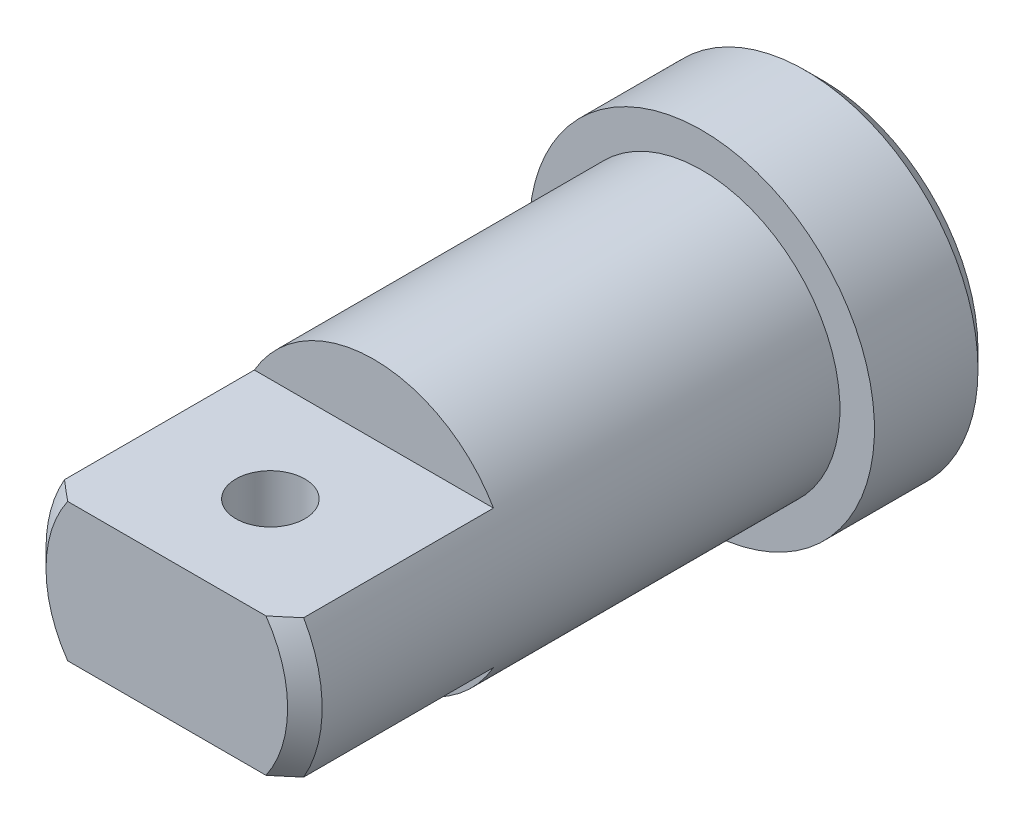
ISO-10303-21;
HEADER;
FILE_DESCRIPTION(('STEP AP214'),'2;1');
FILE_NAME('part.step','',(''),(''),'','','');
FILE_SCHEMA(('AUTOMOTIVE_DESIGN { 1 0 10303 214 1 1 1 1 }'));
ENDSEC;
DATA;
#1=APPLICATION_CONTEXT('core data for automotive mechanical design processes');
#2=APPLICATION_PROTOCOL_DEFINITION('international standard','automotive_design',2000,#1);
#3=PRODUCT_CONTEXT('',#1,'mechanical');
#4=PRODUCT('Part','Part','',(#3));
#5=PRODUCT_RELATED_PRODUCT_CATEGORY('part','',(#4));
#6=PRODUCT_DEFINITION_FORMATION('','',#4);
#7=PRODUCT_DEFINITION_CONTEXT('part definition',#1,'design');
#8=PRODUCT_DEFINITION('design','',#6,#7);
#9=PRODUCT_DEFINITION_SHAPE('','',#8);
#10=(LENGTH_UNIT() NAMED_UNIT(*) SI_UNIT(.MILLI.,.METRE.));
#11=(NAMED_UNIT(*) PLANE_ANGLE_UNIT() SI_UNIT($,.RADIAN.));
#12=(NAMED_UNIT(*) SI_UNIT($,.STERADIAN.) SOLID_ANGLE_UNIT());
#13=UNCERTAINTY_MEASURE_WITH_UNIT(LENGTH_MEASURE(1.E-05),#10,'distance_accuracy_value','');
#14=(GEOMETRIC_REPRESENTATION_CONTEXT(3) GLOBAL_UNCERTAINTY_ASSIGNED_CONTEXT((#13)) GLOBAL_UNIT_ASSIGNED_CONTEXT((#10,
#11,#12)) REPRESENTATION_CONTEXT('',''));
#15=CARTESIAN_POINT('',(0.,0.,0.));
#16=DIRECTION('',(0.,0.,1.));
#17=DIRECTION('',(1.,0.,0.));
#18=AXIS2_PLACEMENT_3D('',#15,#16,#17);
#19=CARTESIAN_POINT('',(-2.25,0.,0.));
#20=DIRECTION('',(0.,0.,-1.));
#21=DIRECTION('',(-1.,0.,0.));
#22=AXIS2_PLACEMENT_3D('',#19,#20,#21);
#23=PLANE('',#22);
#24=CARTESIAN_POINT('',(0.,0.,-2.84218503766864E-10));
#25=DIRECTION('',(0.,0.,1.));
#26=DIRECTION('',(1.,0.,0.));
#27=AXIS2_PLACEMENT_3D('',#24,#25,#26);
#28=CIRCLE('',#27,4.50000000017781);
#29=CARTESIAN_POINT('',(4.50000000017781,0.,-2.84219869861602E-10));
#30=VERTEX_POINT('',#29);
#31=EDGE_CURVE('E18',#30,#30,#28,.T.);
#32=ORIENTED_EDGE('',*,*,#31,.F.);
#33=EDGE_LOOP('',(#32));
#34=FACE_BOUND('',#33,.T.);
#35=ADVANCED_FACE('F15',(#34),#23,.T.);
#36=CARTESIAN_POINT('',(0.,0.,0.500000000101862));
#37=DIRECTION('',(0.,0.,1.));
#38=DIRECTION('',(1.,0.,0.));
#39=AXIS2_PLACEMENT_3D('',#36,#37,#38);
#40=CONICAL_SURFACE('',#39,4.99999999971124,0.785398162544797);
#41=CARTESIAN_POINT('',(0.,0.,0.499999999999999));
#42=DIRECTION('',(0.,0.,-1.));
#43=DIRECTION('',(-1.,0.,0.));
#44=AXIS2_PLACEMENT_3D('',#41,#42,#43);
#45=CIRCLE('',#44,5.);
#46=CARTESIAN_POINT('',(-5.,0.,0.5));
#47=VERTEX_POINT('',#46);
#48=EDGE_CURVE('E104',#47,#47,#45,.F.);
#49=ORIENTED_EDGE('',*,*,#48,.F.);
#50=EDGE_LOOP('',(#49));
#51=FACE_BOUND('',#50,.T.);
#52=ORIENTED_EDGE('',*,*,#31,.T.);
#53=EDGE_LOOP('',(#52));
#54=FACE_BOUND('',#53,.T.);
#55=ADVANCED_FACE('F161',(#51,#54),#40,.T.);
#56=CARTESIAN_POINT('',(0.,2.,16.));
#57=DIRECTION('',(0.,-1.,0.));
#58=DIRECTION('',(0.,0.,-1.));
#59=AXIS2_PLACEMENT_3D('',#56,#57,#58);
#60=CYLINDRICAL_SURFACE('',#59,1.);
#61=CARTESIAN_POINT('',(0.,2.,16.));
#62=DIRECTION('',(0.,-1.,0.));
#63=DIRECTION('',(0.,0.,-1.));
#64=AXIS2_PLACEMENT_3D('',#61,#62,#63);
#65=CIRCLE('',#64,1.);
#66=CARTESIAN_POINT('',(0.,2.,15.));
#67=VERTEX_POINT('',#66);
#68=EDGE_CURVE('E244',#67,#67,#65,.F.);
#69=ORIENTED_EDGE('',*,*,#68,.T.);
#70=EDGE_LOOP('',(#69));
#71=FACE_BOUND('',#70,.T.);
#72=CARTESIAN_POINT('',(0.,-2.,16.));
#73=DIRECTION('',(0.,-1.,0.));
#74=DIRECTION('',(0.,0.,-1.));
#75=AXIS2_PLACEMENT_3D('',#72,#73,#74);
#76=CIRCLE('',#75,1.);
#77=CARTESIAN_POINT('',(0.,-2.,15.));
#78=VERTEX_POINT('',#77);
#79=EDGE_CURVE('E102',#78,#78,#76,.T.);
#80=ORIENTED_EDGE('',*,*,#79,.T.);
#81=EDGE_LOOP('',(#80));
#82=FACE_BOUND('',#81,.T.);
#83=ADVANCED_FACE('F164',(#71,#82),#60,.F.);
#84=CARTESIAN_POINT('',(-1.75,0.,19.));
#85=DIRECTION('',(0.,0.,1.));
#86=DIRECTION('',(1.,0.,0.));
#87=AXIS2_PLACEMENT_3D('',#84,#85,#86);
#88=PLANE('',#87);
#89=DIRECTION('',(1.,0.,0.));
#90=VECTOR('',#89,1.);
#91=CARTESIAN_POINT('',(0.,2.,19.));
#92=LINE('',#91,#90);
#93=CARTESIAN_POINT('',(2.87228132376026,2.,19.0000000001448));
#94=VERTEX_POINT('',#93);
#95=CARTESIAN_POINT('',(-2.87228132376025,2.,19.0000000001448));
#96=VERTEX_POINT('',#95);
#97=EDGE_CURVE('E83',#94,#96,#92,.F.);
#98=ORIENTED_EDGE('',*,*,#97,.T.);
#99=CARTESIAN_POINT('',(0.,0.,19.0000000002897));
#100=DIRECTION('',(0.,0.,-1.));
#101=DIRECTION('',(-1.,0.,0.));
#102=AXIS2_PLACEMENT_3D('',#99,#100,#101);
#103=CIRCLE('',#102,3.5000000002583);
#104=CARTESIAN_POINT('',(-2.87228132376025,-2.,19.0000000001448));
#105=VERTEX_POINT('',#104);
#106=EDGE_CURVE('E84',#105,#96,#103,.T.);
#107=ORIENTED_EDGE('',*,*,#106,.F.);
#108=DIRECTION('',(1.,0.,0.));
#109=VECTOR('',#108,1.);
#110=CARTESIAN_POINT('',(0.,-2.,19.));
#111=LINE('',#110,#109);
#112=CARTESIAN_POINT('',(2.87228132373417,-2.,19.0000000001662));
#113=VERTEX_POINT('',#112);
#114=EDGE_CURVE('E100',#105,#113,#111,.T.);
#115=ORIENTED_EDGE('',*,*,#114,.T.);
#116=CARTESIAN_POINT('',(0.,0.,19.0000000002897));
#117=DIRECTION('',(0.,0.,-1.));
#118=DIRECTION('',(-1.,0.,0.));
#119=AXIS2_PLACEMENT_3D('',#116,#117,#118);
#120=CIRCLE('',#119,3.5000000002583);
#121=EDGE_CURVE('E117',#94,#113,#120,.T.);
#122=ORIENTED_EDGE('',*,*,#121,.F.);
#123=EDGE_LOOP('',(#98,#107,#115,#122));
#124=FACE_BOUND('',#123,.T.);
#125=ADVANCED_FACE('F157',(#124),#88,.T.);
#126=CARTESIAN_POINT('',(0.,0.,2.));
#127=DIRECTION('',(0.,0.,-1.));
#128=DIRECTION('',(-1.,0.,0.));
#129=AXIS2_PLACEMENT_3D('',#126,#127,#128);
#130=CYLINDRICAL_SURFACE('',#129,5.);
#131=CARTESIAN_POINT('',(0.,0.,3.5));
#132=DIRECTION('',(0.,0.,-1.));
#133=DIRECTION('',(-1.,0.,0.));
#134=AXIS2_PLACEMENT_3D('',#131,#132,#133);
#135=CIRCLE('',#134,5.);
#136=CARTESIAN_POINT('',(-5.,0.,3.5));
#137=VERTEX_POINT('',#136);
#138=EDGE_CURVE('E108',#137,#137,#135,.F.);
#139=ORIENTED_EDGE('',*,*,#138,.F.);
#140=EDGE_LOOP('',(#139));
#141=FACE_BOUND('',#140,.T.);
#142=ORIENTED_EDGE('',*,*,#48,.T.);
#143=EDGE_LOOP('',(#142));
#144=FACE_BOUND('',#143,.T.);
#145=ADVANCED_FACE('F153',(#141,#144),#130,.T.);
#146=CARTESIAN_POINT('',(0.,-2.,13.));
#147=DIRECTION('',(0.,0.,-1.));
#148=DIRECTION('',(-1.,0.,0.));
#149=AXIS2_PLACEMENT_3D('',#146,#147,#148);
#150=PLANE('',#149);
#151=DIRECTION('',(1.,0.,0.));
#152=VECTOR('',#151,1.);
#153=CARTESIAN_POINT('',(0.,-2.,13.));
#154=LINE('',#153,#152);
#155=CARTESIAN_POINT('',(3.46410161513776,-2.,13.));
#156=VERTEX_POINT('',#155);
#157=CARTESIAN_POINT('',(-3.46410161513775,-2.,13.));
#158=VERTEX_POINT('',#157);
#159=EDGE_CURVE('E68',#156,#158,#154,.F.);
#160=ORIENTED_EDGE('',*,*,#159,.T.);
#161=CARTESIAN_POINT('',(0.,0.,13.));
#162=DIRECTION('',(0.,0.,-1.));
#163=DIRECTION('',(-1.,0.,0.));
#164=AXIS2_PLACEMENT_3D('',#161,#162,#163);
#165=CIRCLE('',#164,4.);
#166=EDGE_CURVE('E99',#156,#158,#165,.T.);
#167=ORIENTED_EDGE('',*,*,#166,.F.);
#168=EDGE_LOOP('',(#160,#167));
#169=FACE_BOUND('',#168,.T.);
#170=ADVANCED_FACE('F156',(#169),#150,.F.);
#171=CARTESIAN_POINT('',(0.,-2.,19.));
#172=DIRECTION('',(0.,1.,0.));
#173=DIRECTION('',(0.,0.,1.));
#174=AXIS2_PLACEMENT_3D('',#171,#172,#173);
#175=PLANE('',#174);
#176=ORIENTED_EDGE('',*,*,#79,.F.);
#177=EDGE_LOOP('',(#176));
#178=FACE_BOUND('',#177,.T.);
#179=CARTESIAN_POINT('',(2.87228132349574,-1.99999999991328,19.0000000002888));
#180=CARTESIAN_POINT('',(2.92219200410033,-1.99999999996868,18.9590386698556));
#181=CARTESIAN_POINT('',(2.97193339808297,-1.99999999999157,18.9178717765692));
#182=CARTESIAN_POINT('',(3.07110851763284,-2.00000000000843,18.835173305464));
#183=CARTESIAN_POINT('',(3.12054225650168,-2.00000000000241,18.7936417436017));
#184=CARTESIAN_POINT('',(3.21913690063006,-1.99999999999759,18.7102571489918));
#185=CARTESIAN_POINT('',(3.26829780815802,-1.9999999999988,18.668404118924));
#186=CARTESIAN_POINT('',(3.36637615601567,-2.0000000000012,18.5844093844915));
#187=CARTESIAN_POINT('',(3.4152935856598,-2.00000000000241,18.5422676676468));
#188=CARTESIAN_POINT('',(3.46410161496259,-2.,18.4999999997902));
#189=B_SPLINE_CURVE_WITH_KNOTS('',3,(#179,#180,#181,#182,#183,#184,#185,#186,#187,#188),
.UNSPECIFIED.,.F.,.F.,(4,2,2,2,4),(0.,0.193700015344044,0.387391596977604,0.581081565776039,
0.77477996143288),.UNSPECIFIED.);
#190=CARTESIAN_POINT('',(3.46410161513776,-2.,18.4999999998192));
#191=VERTEX_POINT('',#190);
#192=EDGE_CURVE('E126',#113,#191,#189,.T.);
#193=ORIENTED_EDGE('',*,*,#192,.F.);
#194=ORIENTED_EDGE('',*,*,#114,.F.);
#195=CARTESIAN_POINT('',(-3.46410161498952,-2.00000000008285,18.4999999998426));
#196=CARTESIAN_POINT('',(-3.41529358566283,-2.00000000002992,18.5422676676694));
#197=CARTESIAN_POINT('',(-3.36637615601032,-2.00000000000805,18.5844093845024));
#198=CARTESIAN_POINT('',(-3.26829780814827,-1.99999999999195,18.668404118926));
#199=CARTESIAN_POINT('',(-3.2191369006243,-1.9999999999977,18.7102571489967));
#200=CARTESIAN_POINT('',(-3.12054225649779,-2.0000000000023,18.793641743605));
#201=CARTESIAN_POINT('',(-3.07110851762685,-2.00000000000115,18.8351733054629));
#202=CARTESIAN_POINT('',(-2.97193339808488,-1.99999999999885,18.9178717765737));
#203=CARTESIAN_POINT('',(-2.92219200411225,-1.9999999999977,18.9590386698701));
#204=CARTESIAN_POINT('',(-2.87228132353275,-2.,19.0000000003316));
#205=B_SPLINE_CURVE_WITH_KNOTS('',3,(#195,#196,#197,#198,#199,#200,#201,#202,#203,#204),
.UNSPECIFIED.,.F.,.F.,(4,2,2,2,4),(0.,0.193698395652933,0.387388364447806,0.581079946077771,
0.774779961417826),.UNSPECIFIED.);
#206=CARTESIAN_POINT('',(-3.46410161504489,-2.,18.4999999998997));
#207=VERTEX_POINT('',#206);
#208=EDGE_CURVE('E62',#207,#105,#205,.T.);
#209=ORIENTED_EDGE('',*,*,#208,.F.);
#210=DIRECTION('',(0.,0.,-1.));
#211=VECTOR('',#210,1.);
#212=CARTESIAN_POINT('',(-3.46410161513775,-2.,11.));
#213=LINE('',#212,#211);
#214=EDGE_CURVE('E94',#158,#207,#213,.F.);
#215=ORIENTED_EDGE('',*,*,#214,.F.);
#216=ORIENTED_EDGE('',*,*,#159,.F.);
#217=DIRECTION('',(0.,0.,-1.));
#218=VECTOR('',#217,1.);
#219=CARTESIAN_POINT('',(3.46410161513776,-2.,11.));
#220=LINE('',#219,#218);
#221=EDGE_CURVE('E105',#191,#156,#220,.T.);
#222=ORIENTED_EDGE('',*,*,#221,.F.);
#223=EDGE_LOOP('',(#193,#194,#209,#215,#216,#222));
#224=FACE_BOUND('',#223,.T.);
#225=ADVANCED_FACE('F202',(#178,#224),#175,.F.);
#226=CARTESIAN_POINT('',(0.,0.,18.4999999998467));
#227=DIRECTION('',(0.,0.,-1.));
#228=DIRECTION('',(-1.,0.,0.));
#229=AXIS2_PLACEMENT_3D('',#226,#227,#228);
#230=CONICAL_SURFACE('',#229,3.99999999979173,0.785398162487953);
#231=CARTESIAN_POINT('',(-2.87228132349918,1.99999999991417,19.0000000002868));
#232=CARTESIAN_POINT('',(-2.92219200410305,1.99999999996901,18.9590386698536));
#233=CARTESIAN_POINT('',(-2.97193339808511,1.99999999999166,18.9178717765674));
#234=CARTESIAN_POINT('',(-3.07110851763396,2.00000000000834,18.835173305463));
#235=CARTESIAN_POINT('',(-3.12054225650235,2.00000000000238,18.7936417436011));
#236=CARTESIAN_POINT('',(-3.21913690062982,1.99999999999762,18.710257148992));
#237=CARTESIAN_POINT('',(-3.2682978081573,1.99999999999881,18.6684041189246));
#238=CARTESIAN_POINT('',(-3.36637615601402,2.00000000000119,18.5844093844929));
#239=CARTESIAN_POINT('',(-3.41529358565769,2.00000000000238,18.5422676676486));
#240=CARTESIAN_POINT('',(-3.46410161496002,2.,18.4999999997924));
#241=B_SPLINE_CURVE_WITH_KNOTS('',3,(#231,#232,#233,#234,#235,#236,#237,#238,#239,#240),
.UNSPECIFIED.,.F.,.F.,(4,2,2,2,4),(0.,0.193700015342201,0.387391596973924,0.581081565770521,
0.774779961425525),.UNSPECIFIED.);
#242=CARTESIAN_POINT('',(-3.4641016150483,2.,18.4999999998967));
#243=VERTEX_POINT('',#242);
#244=EDGE_CURVE('E245',#96,#243,#241,.T.);
#245=ORIENTED_EDGE('',*,*,#244,.T.);
#246=CARTESIAN_POINT('',(0.,0.,18.5));
#247=DIRECTION('',(0.,0.,-1.));
#248=DIRECTION('',(-1.,0.,0.));
#249=AXIS2_PLACEMENT_3D('',#246,#247,#248);
#250=CIRCLE('',#249,4.);
#251=EDGE_CURVE('E92',#207,#243,#250,.T.);
#252=ORIENTED_EDGE('',*,*,#251,.F.);
#253=ORIENTED_EDGE('',*,*,#208,.T.);
#254=ORIENTED_EDGE('',*,*,#106,.T.);
#255=EDGE_LOOP('',(#245,#252,#253,#254));
#256=FACE_BOUND('',#255,.T.);
#257=ADVANCED_FACE('F209',(#256),#230,.T.);
#258=CARTESIAN_POINT('',(0.,4.,13.));
#259=DIRECTION('',(0.,0.,-1.));
#260=DIRECTION('',(-1.,0.,0.));
#261=AXIS2_PLACEMENT_3D('',#258,#259,#260);
#262=PLANE('',#261);
#263=DIRECTION('',(1.,0.,0.));
#264=VECTOR('',#263,1.);
#265=CARTESIAN_POINT('',(0.,2.,13.));
#266=LINE('',#265,#264);
#267=CARTESIAN_POINT('',(-3.46410161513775,2.,13.));
#268=VERTEX_POINT('',#267);
#269=CARTESIAN_POINT('',(3.46410161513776,2.,13.));
#270=VERTEX_POINT('',#269);
#271=EDGE_CURVE('E72',#268,#270,#266,.T.);
#272=ORIENTED_EDGE('',*,*,#271,.T.);
#273=CARTESIAN_POINT('',(0.,0.,13.));
#274=DIRECTION('',(0.,0.,-1.));
#275=DIRECTION('',(-1.,0.,0.));
#276=AXIS2_PLACEMENT_3D('',#273,#274,#275);
#277=CIRCLE('',#276,4.);
#278=EDGE_CURVE('E86',#268,#270,#277,.T.);
#279=ORIENTED_EDGE('',*,*,#278,.F.);
#280=EDGE_LOOP('',(#272,#279));
#281=FACE_BOUND('',#280,.T.);
#282=ADVANCED_FACE('F87',(#281),#262,.F.);
#283=CARTESIAN_POINT('',(0.,2.,13.));
#284=DIRECTION('',(0.,-1.,0.));
#285=DIRECTION('',(0.,0.,-1.));
#286=AXIS2_PLACEMENT_3D('',#283,#284,#285);
#287=PLANE('',#286);
#288=ORIENTED_EDGE('',*,*,#68,.F.);
#289=EDGE_LOOP('',(#288));
#290=FACE_BOUND('',#289,.T.);
#291=ORIENTED_EDGE('',*,*,#97,.F.);
#292=CARTESIAN_POINT('',(3.46410161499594,2.00000000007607,18.4999999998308));
#293=CARTESIAN_POINT('',(3.41529358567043,2.00000000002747,18.5422676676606));
#294=CARTESIAN_POINT('',(3.36637615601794,2.0000000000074,18.5844093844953));
#295=CARTESIAN_POINT('',(3.26829780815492,1.9999999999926,18.6684041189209));
#296=CARTESIAN_POINT('',(3.21913690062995,1.99999999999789,18.7102571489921));
#297=CARTESIAN_POINT('',(3.1205422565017,2.00000000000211,18.7936417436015));
#298=CARTESIAN_POINT('',(3.07110851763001,2.00000000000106,18.8351733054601));
#299=CARTESIAN_POINT('',(2.97193339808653,1.99999999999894,18.9178717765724));
#300=CARTESIAN_POINT('',(2.92219200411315,1.99999999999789,18.9590386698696));
#301=CARTESIAN_POINT('',(2.87228132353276,2.,19.0000000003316));
#302=B_SPLINE_CURVE_WITH_KNOTS('',3,(#292,#293,#294,#295,#296,#297,#298,#299,#300,#301),
.UNSPECIFIED.,.F.,.F.,(4,2,2,2,4),(0.,0.193698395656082,0.38738836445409,0.581079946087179,
0.774779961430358),.UNSPECIFIED.);
#303=CARTESIAN_POINT('',(3.46410161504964,2.,18.4999999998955));
#304=VERTEX_POINT('',#303);
#305=EDGE_CURVE('E33',#304,#94,#302,.T.);
#306=ORIENTED_EDGE('',*,*,#305,.F.);
#307=DIRECTION('',(0.,0.,-1.));
#308=VECTOR('',#307,1.);
#309=CARTESIAN_POINT('',(3.46410161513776,2.,11.));
#310=LINE('',#309,#308);
#311=EDGE_CURVE('E80',#270,#304,#310,.F.);
#312=ORIENTED_EDGE('',*,*,#311,.F.);
#313=ORIENTED_EDGE('',*,*,#271,.F.);
#314=DIRECTION('',(0.,0.,-1.));
#315=VECTOR('',#314,1.);
#316=CARTESIAN_POINT('',(-3.46410161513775,2.,11.));
#317=LINE('',#316,#315);
#318=EDGE_CURVE('E77',#243,#268,#317,.T.);
#319=ORIENTED_EDGE('',*,*,#318,.F.);
#320=ORIENTED_EDGE('',*,*,#244,.F.);
#321=EDGE_LOOP('',(#291,#306,#312,#313,#319,#320));
#322=FACE_BOUND('',#321,.T.);
#323=ADVANCED_FACE('F74',(#290,#322),#287,.F.);
#324=CARTESIAN_POINT('',(0.,0.,18.4999999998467));
#325=DIRECTION('',(0.,0.,-1.));
#326=DIRECTION('',(-1.,0.,0.));
#327=AXIS2_PLACEMENT_3D('',#324,#325,#326);
#328=CONICAL_SURFACE('',#327,3.99999999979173,0.785398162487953);
#329=ORIENTED_EDGE('',*,*,#305,.T.);
#330=ORIENTED_EDGE('',*,*,#121,.T.);
#331=ORIENTED_EDGE('',*,*,#192,.T.);
#332=CARTESIAN_POINT('',(0.,0.,18.5));
#333=DIRECTION('',(0.,0.,-1.));
#334=DIRECTION('',(-1.,0.,0.));
#335=AXIS2_PLACEMENT_3D('',#332,#333,#334);
#336=CIRCLE('',#335,4.);
#337=EDGE_CURVE('E24',#304,#191,#336,.T.);
#338=ORIENTED_EDGE('',*,*,#337,.F.);
#339=EDGE_LOOP('',(#329,#330,#331,#338));
#340=FACE_BOUND('',#339,.T.);
#341=ADVANCED_FACE('F134',(#340),#328,.T.);
#342=CARTESIAN_POINT('',(-4.5,0.,3.5));
#343=DIRECTION('',(0.,0.,1.));
#344=DIRECTION('',(1.,0.,0.));
#345=AXIS2_PLACEMENT_3D('',#342,#343,#344);
#346=PLANE('',#345);
#347=CARTESIAN_POINT('',(0.,0.,3.5));
#348=DIRECTION('',(0.,0.,-1.));
#349=DIRECTION('',(-1.,0.,0.));
#350=AXIS2_PLACEMENT_3D('',#347,#348,#349);
#351=CIRCLE('',#350,4.);
#352=CARTESIAN_POINT('',(-4.,0.,3.5));
#353=VERTEX_POINT('',#352);
#354=EDGE_CURVE('E10',#353,#353,#351,.F.);
#355=ORIENTED_EDGE('',*,*,#354,.F.);
#356=EDGE_LOOP('',(#355));
#357=FACE_BOUND('',#356,.T.);
#358=ORIENTED_EDGE('',*,*,#138,.T.);
#359=EDGE_LOOP('',(#358));
#360=FACE_BOUND('',#359,.T.);
#361=ADVANCED_FACE('F138',(#357,#360),#346,.T.);
#362=CARTESIAN_POINT('',(0.,0.,11.));
#363=DIRECTION('',(0.,0.,-1.));
#364=DIRECTION('',(-1.,0.,0.));
#365=AXIS2_PLACEMENT_3D('',#362,#363,#364);
#366=CYLINDRICAL_SURFACE('',#365,4.);
#367=ORIENTED_EDGE('',*,*,#354,.T.);
#368=EDGE_LOOP('',(#367));
#369=FACE_BOUND('',#368,.T.);
#370=ORIENTED_EDGE('',*,*,#311,.T.);
#371=ORIENTED_EDGE('',*,*,#337,.T.);
#372=ORIENTED_EDGE('',*,*,#221,.T.);
#373=ORIENTED_EDGE('',*,*,#166,.T.);
#374=ORIENTED_EDGE('',*,*,#214,.T.);
#375=ORIENTED_EDGE('',*,*,#251,.T.);
#376=ORIENTED_EDGE('',*,*,#318,.T.);
#377=ORIENTED_EDGE('',*,*,#278,.T.);
#378=EDGE_LOOP('',(#370,#371,#372,#373,#374,#375,#376,#377));
#379=FACE_BOUND('',#378,.T.);
#380=ADVANCED_FACE('F90',(#369,#379),#366,.T.);
#381=CLOSED_SHELL('',(#35,#55,#83,#125,#145,#170,#225,#257,#282,#323,#341,#361,#380));
#382=MANIFOLD_SOLID_BREP('B1',#381);
#383=ADVANCED_BREP_SHAPE_REPRESENTATION('',(#18,#382),#14);
#384=SHAPE_DEFINITION_REPRESENTATION(#9,#383);
ENDSEC;
END-ISO-10303-21;
